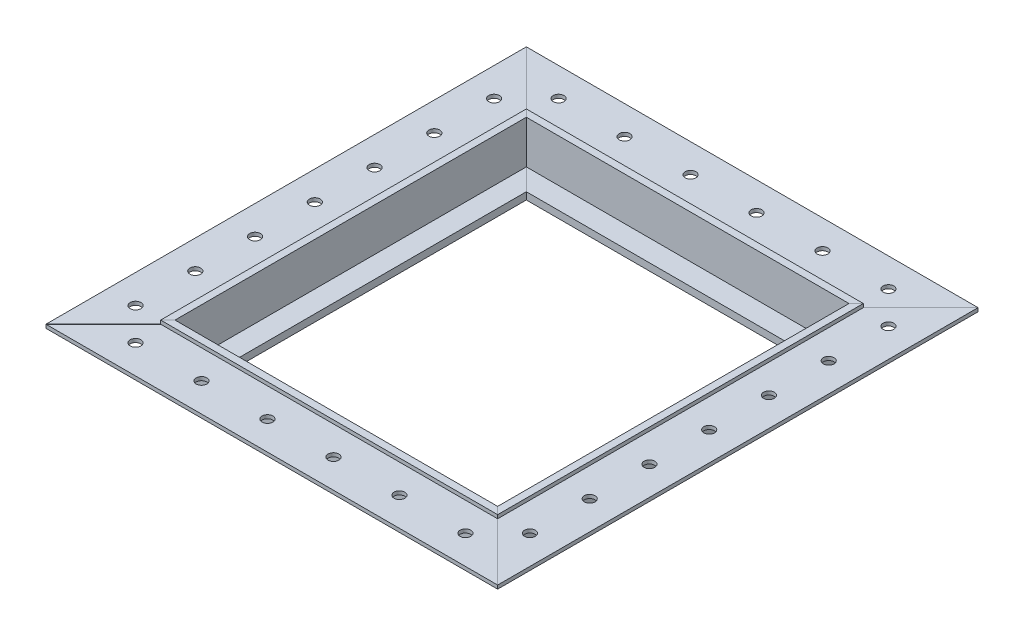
from build123d import *

# Parameters (mm, degrees)
BOSS_EXTRUDE1_DEPTH   = 77.7875
BOSS_EXTRUDE1_2_DEPTH = 77.7875
BOSS_EXTRUDE2_DEPTH   = 100.0125
SKETCH4_W             = 25.4
SKETCH4_H             = 212.725
CUT_EXTRUDE1_DEPTH    = 158.75
SKETCH5_W             = 25.4
SKETCH5_H             = 19.05
CUT_EXTRUDE2_DEPTH    = 249.604730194
CUT_EXTRUDE3_DEPTH    = 196.004199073
SKETCH7_R             = 2.38125
CUT_EXTRUDE4_DEPTH    = 2.54
LPATTERN1_COUNT       = 7
LPATTERN1_PITCH       = 26.458333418
SKETCH8_R             = 2.3749
CUT_EXTRUDE5_DEPTH    = 2.54
LPATTERN2_COUNT       = 6
LPATTERN2_PITCH       = 29.21
SKETCH9_R             = 2.3749
SKETCH9_R_2           = 2.38125
CUT_EXTRUDE6_DEPTH    = 2.54


with BuildPart() as part:
    # Sketch1 → Boss-Extrude1 (new, symmetric)
    with BuildSketch(Plane.XY):
        Polygon((123.825, 3.175), (123.825, 0), (136.525, 0), (136.525, 19.05), (161.925, 19.05), (161.925, 20.6375), (136.525, 20.6375), (136.525, 22.225), (133.35, 22.225), (133.35, 3.175), align=None)
    extrude(amount=BOSS_EXTRUDE1_DEPTH, both=True)



with BuildPart() as body_2:
    # Sketch1 → Boss-Extrude1 2 (new, symmetric)
    with BuildSketch(Plane.XY):
        Polygon((0, 0), (-12.7, 0), (-12.7, 19.05), (-38.1, 19.05), (-38.1, 20.6375), (-12.7, 20.6375), (-12.7, 22.225), (-9.525, 22.225), (-9.525, 3.175), (0, 3.175), align=None)
    extrude(amount=BOSS_EXTRUDE1_2_DEPTH, both=True)


with BuildPart() as part_1:
    add(part.part)

    add(body_2.part)  # Boss-Extrude2 merges body 2
    # Sketch3 → Boss-Extrude2 (add, symmetric)
    with BuildSketch(Plane.ZY.offset(-61.9125)):
        Polygon((-68.2625, 3.175), (-68.2625, 0), (-80.9625, 0), (-80.9625, 19.05), (-106.3625, 19.05), (-106.3625, 20.6375), (-80.9625, 20.6375), (-80.9625, 22.225), (-77.7875, 22.225), (-77.7875, 3.175), align=None)
        Polygon((68.2625, 3.175), (68.2625, 0), (80.9625, 0), (80.9625, 19.05), (106.3625, 19.05), (106.3625, 20.6375), (80.9625, 20.6375), (80.9625, 22.225), (77.7875, 22.225), (77.7875, 3.175), align=None)
    extrude(amount=BOSS_EXTRUDE2_DEPTH, both=True)

    # Sketch4 → Cut-Extrude1 (cut)
    with BuildSketch(Plane(origin=(0, 20.6375, 0), x_dir=(1, 0, 0), z_dir=(0, 1, 0))):
        with Locations((149.225, 0)):
            Rectangle(SKETCH4_W, SKETCH4_H)
        with Locations((-25.4, 0)):
            Rectangle(SKETCH4_W, SKETCH4_H)
    extrude(amount=CUT_EXTRUDE1_DEPTH, mode=Mode.SUBTRACT)

    # Sketch5 → Cut-Extrude2 (cut, through all)
    with BuildSketch(Plane.XY.offset(80.9625)):
        with Locations((-25.4, 9.525)):
            Rectangle(SKETCH5_W, SKETCH5_H)
        with Locations((149.225, 9.525)):
            Rectangle(SKETCH5_W, SKETCH5_H)
    extrude(amount=-CUT_EXTRUDE2_DEPTH, mode=Mode.SUBTRACT)

    # Sketch6 → Cut-Extrude3 (cut, through all)
    with BuildSketch(Plane(origin=(0, 22.225, 0), x_dir=(1, 0, 0), z_dir=(0, 1, 0))):
        Polygon((161.907039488, 106.380460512), (114.638990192, 59.112411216), (115.032679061, 59.434258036), (161.942960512, 106.344539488), align=None)
        Polygon((-38.082039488, 106.380460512), (-38.117960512, 106.344539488), (8.792320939, 59.434258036), (9.186009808, 59.112411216), align=None)
        Polygon((-38.082039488, -106.380460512), (9.186009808, -59.112411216), (8.792320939, -59.434258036), (-38.117960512, -106.344539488), align=None)
        Polygon((161.907039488, -106.380460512), (161.942960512, -106.344539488), (115.032679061, -59.434258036), (114.638990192, -59.112411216), align=None)
    extrude(amount=-CUT_EXTRUDE3_DEPTH, mode=Mode.SUBTRACT)


with BuildPart() as cut_extrude3_piece_1:
    # of the separate pieces the step leaves, piece 1, a body of its own (cut_extrude3_pieces)
    add(part_1.part.solids().sort_by_distance((-9.525, 3.175, -77.751578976))[0])

    # Sketch7 → Cut-Extrude4 (cut)
    with BuildSketch(Plane(origin=(0, 20.6375, 0), x_dir=(1, 0, 0), z_dir=(0, 1, 0))):
        with Locations(Location((-25.4, 79.375, 0), (0, 0, 180))):
            Circle(SKETCH7_R)
    cut_extrude4 = extrude(amount=-CUT_EXTRUDE4_DEPTH, mode=Mode.SUBTRACT)

    # LPattern1: Cut-Extrude4 ×7
    with Locations(*[(0, 0, i * LPATTERN1_PITCH) for i in range(1, LPATTERN1_COUNT)]):
        add(cut_extrude4, mode=Mode.SUBTRACT)


with BuildPart() as cut_extrude3_piece_2:
    # of the separate pieces the step leaves, piece 2, a body of its own (cut_extrude3_pieces)
    add(part_1.part.solids().sort_by_distance((133.35, 3.175, 77.751578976))[0])


with BuildPart() as cut_extrude3_piece_3:
    # of the separate pieces the step leaves, piece 3, a body of its own (cut_extrude3_pieces)
    add(part_1.part.solids().sort_by_distance((133.314078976, 3.175, -77.7875))[0])

    # Sketch8 → Cut-Extrude5 (cut)
    with BuildSketch(Plane(origin=(0, 20.6375, 0), x_dir=(1, 0, 0), z_dir=(0, 1, 0))):
        with Locations(Location((-11.1125, 93.6625, 0), (0, 0, 180))):
            Circle(SKETCH8_R)
    cut_extrude5 = extrude(amount=-CUT_EXTRUDE5_DEPTH, mode=Mode.SUBTRACT)

    # LPattern2: Cut-Extrude5 ×6
    with Locations(*[(i * LPATTERN2_PITCH, 0, 0) for i in range(1, LPATTERN2_COUNT)]):
        add(cut_extrude5, mode=Mode.SUBTRACT)


with BuildPart() as cut_extrude3_piece_4:
    # of the separate pieces the step leaves, piece 4, a body of its own (cut_extrude3_pieces)
    add(part_1.part.solids().sort_by_distance((-9.489078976, 3.175, 77.7875))[0])


with BuildPart() as cut_extrude6_tool:
    # Sketch9 → Cut-Extrude6 (new body)
    with BuildSketch(Plane(origin=(0, 20.6375, 0), x_dir=(1, 0, 0), z_dir=(0, 1, 0))):
        with Locations(Location((-11.1125, -93.6625, 0), (0, 0, 270))):
            Circle(SKETCH9_R)
        with Locations(Location((18.0975, -93.6625, 0), (0, 0, 270))):
            Circle(SKETCH9_R)
        with Locations(Location((47.3075, -93.6625, 0), (0, 0, 270))):
            Circle(SKETCH9_R)
        with Locations(Location((76.5175, -93.6625, 0), (0, 0, 270))):
            Circle(SKETCH9_R)
        with Locations(Location((105.7275, -93.6625, 0), (0, 0, 270))):
            Circle(SKETCH9_R)
        with Locations(Location((134.9375, -93.6625, 0), (0, 0, 270))):
            Circle(SKETCH9_R)
        with Locations(Location((149.225, 79.375, 0), (0, 0, 270))):
            Circle(SKETCH9_R_2)
        with Locations(Location((149.225, 52.916666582, 0), (0, 0, 270))):
            Circle(SKETCH9_R_2)
        with Locations(Location((149.225, 26.458333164, 0), (0, 0, 270))):
            Circle(SKETCH9_R_2)
        with Locations(Location((149.225, -2.54e-07, 0), (0, 0, 270))):
            Circle(SKETCH9_R_2)
        with Locations(Location((149.225, -26.458333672, 0), (0, 0, 270))):
            Circle(SKETCH9_R_2)
        with Locations(Location((149.225, -52.91666709, 0), (0, 0, 270))):
            Circle(SKETCH9_R_2)
        with Locations(Location((149.225, -79.375000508, 0), (0, 0, 270))):
            Circle(SKETCH9_R_2)
    extrude(amount=-CUT_EXTRUDE6_DEPTH)


with BuildPart() as cut_extrude3_piece_2_1:
    add(cut_extrude3_piece_2.part)

    # Cut-Extrude6: cut by cut_extrude6_tool
    add(cut_extrude6_tool.part, mode=Mode.SUBTRACT)


with BuildPart() as cut_extrude3_piece_4_1:
    add(cut_extrude3_piece_4.part)

    # Cut-Extrude6: cut by cut_extrude6_tool
    add(cut_extrude6_tool.part, mode=Mode.SUBTRACT)


solid = Compound([cut_extrude3_piece_1.part, cut_extrude3_piece_3.part, cut_extrude3_piece_2_1.part, cut_extrude3_piece_4_1.part])
